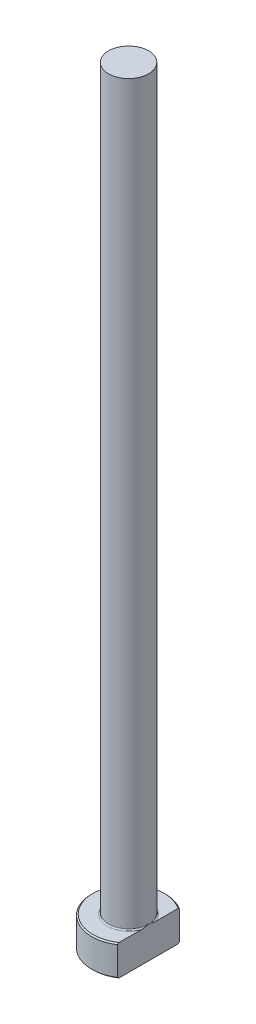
from build123d import *
from build123d.topology import SkipClean

# Parameters (mm, degrees)
CHAMFER1_SIZE = 0.2
FILLET1_R     = 0.2
KEY_DEPTH     = 126.287668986


with BuildPart() as part:
    # Sketch1 → Revolve1 (revolve)
    with BuildSketch(Plane.XY, mode=Mode.PRIVATE) as revolve1_sk:
        Polygon((0, 0), (-6, 0), (-6, 5), (-3.25, 5), (-3.25, 125), (0, 125), align=None)
    revolve(revolve1_sk.sketch.rotate(Axis((0, 259.958771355, 0), (0, -1, 0)), 270), axis=Axis((0, 259.958771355, 0), (0, -1, 0)))

    # Chamfer1
    chamfer1_edges = [part.edges().sort_by_distance(p)[0] for p in [
        (0, 5, -6),
        (0, 0, -6),
    ]]
    chamfer(chamfer1_edges, length=CHAMFER1_SIZE)

    # Fillet1
    fillet1_edges = [part.edges().sort_by_distance(p)[0] for p in [
        (0, 5, -3.25),
    ]]
    fillet(fillet1_edges, radius=FILLET1_R)

    # Sketch2 → KEY (cut, through all)
    with SkipClean():  # the faces are left unmerged after this step: merging them gives an invalid solid
        with BuildSketch(Plane(origin=(0, 0, 0), x_dir=(1, 0, 0), z_dir=(0, 1, 0))):
            with BuildLine():
                Line((3.25, 5.04356025), (3.25, -5.04356025))
                ThreePointArc((3.25, -5.04356025), (6, 0), (3.25, 5.04356025))
            make_face()
        extrude(amount=KEY_DEPTH, mode=Mode.SUBTRACT)


solid = part.part
